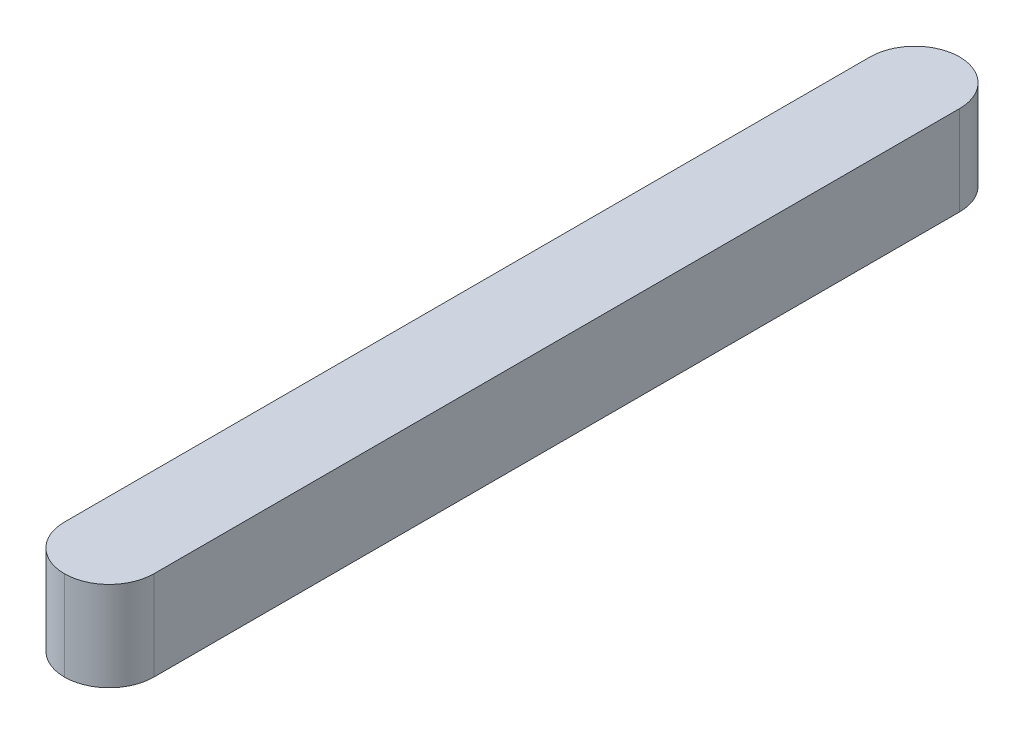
ISO-10303-21;
HEADER;
FILE_DESCRIPTION(('STEP AP214'),'2;1');
FILE_NAME('part.step','',(''),(''),'','','');
FILE_SCHEMA(('AUTOMOTIVE_DESIGN { 1 0 10303 214 1 1 1 1 }'));
ENDSEC;
DATA;
#1=APPLICATION_CONTEXT('core data for automotive mechanical design processes');
#2=APPLICATION_PROTOCOL_DEFINITION('international standard','automotive_design',2000,#1);
#3=PRODUCT_CONTEXT('',#1,'mechanical');
#4=PRODUCT('Part','Part','',(#3));
#5=PRODUCT_RELATED_PRODUCT_CATEGORY('part','',(#4));
#6=PRODUCT_DEFINITION_FORMATION('','',#4);
#7=PRODUCT_DEFINITION_CONTEXT('part definition',#1,'design');
#8=PRODUCT_DEFINITION('design','',#6,#7);
#9=PRODUCT_DEFINITION_SHAPE('','',#8);
#10=(LENGTH_UNIT() NAMED_UNIT(*) SI_UNIT(.MILLI.,.METRE.));
#11=(NAMED_UNIT(*) PLANE_ANGLE_UNIT() SI_UNIT($,.RADIAN.));
#12=(NAMED_UNIT(*) SI_UNIT($,.STERADIAN.) SOLID_ANGLE_UNIT());
#13=UNCERTAINTY_MEASURE_WITH_UNIT(LENGTH_MEASURE(1.E-05),#10,'distance_accuracy_value','');
#14=(GEOMETRIC_REPRESENTATION_CONTEXT(3) GLOBAL_UNCERTAINTY_ASSIGNED_CONTEXT((#13)) GLOBAL_UNIT_ASSIGNED_CONTEXT((#10,
#11,#12)) REPRESENTATION_CONTEXT('',''));
#15=CARTESIAN_POINT('',(0.,0.,0.));
#16=DIRECTION('',(0.,0.,1.));
#17=DIRECTION('',(1.,0.,0.));
#18=AXIS2_PLACEMENT_3D('',#15,#16,#17);
#19=CARTESIAN_POINT('',(0.,0.,60.));
#20=DIRECTION('',(1.,0.,0.));
#21=DIRECTION('',(0.,0.,-1.));
#22=AXIS2_PLACEMENT_3D('',#19,#20,#21);
#23=PLANE('',#22);
#24=DIRECTION('',(0.,0.,-1.));
#25=VECTOR('',#24,1.);
#26=CARTESIAN_POINT('',(0.,0.,60.));
#27=LINE('',#26,#25);
#28=CARTESIAN_POINT('',(0.,0.,57.));
#29=VERTEX_POINT('',#28);
#30=CARTESIAN_POINT('',(0.,0.,3.));
#31=VERTEX_POINT('',#30);
#32=EDGE_CURVE('E110',#29,#31,#27,.T.);
#33=ORIENTED_EDGE('',*,*,#32,.F.);
#34=DIRECTION('',(0.,-1.,0.));
#35=VECTOR('',#34,1.);
#36=CARTESIAN_POINT('',(0.,0.,57.));
#37=LINE('',#36,#35);
#38=CARTESIAN_POINT('',(0.,6.,57.));
#39=VERTEX_POINT('',#38);
#40=EDGE_CURVE('E11',#29,#39,#37,.F.);
#41=ORIENTED_EDGE('',*,*,#40,.T.);
#42=DIRECTION('',(0.,0.,-1.));
#43=VECTOR('',#42,1.);
#44=CARTESIAN_POINT('',(0.,6.,60.));
#45=LINE('',#44,#43);
#46=CARTESIAN_POINT('',(0.,6.,3.));
#47=VERTEX_POINT('',#46);
#48=EDGE_CURVE('E106',#39,#47,#45,.T.);
#49=ORIENTED_EDGE('',*,*,#48,.T.);
#50=DIRECTION('',(0.,-1.,0.));
#51=VECTOR('',#50,1.);
#52=CARTESIAN_POINT('',(0.,0.,3.));
#53=LINE('',#52,#51);
#54=EDGE_CURVE('E39',#47,#31,#53,.T.);
#55=ORIENTED_EDGE('',*,*,#54,.T.);
#56=EDGE_LOOP('',(#33,#41,#49,#55));
#57=FACE_BOUND('',#56,.T.);
#58=ADVANCED_FACE('F32',(#57),#23,.F.);
#59=CARTESIAN_POINT('',(0.,0.,60.));
#60=DIRECTION('',(0.,1.,0.));
#61=DIRECTION('',(0.,0.,1.));
#62=AXIS2_PLACEMENT_3D('',#59,#60,#61);
#63=PLANE('',#62);
#64=DIRECTION('',(0.,0.,-1.));
#65=VECTOR('',#64,1.);
#66=CARTESIAN_POINT('',(6.,0.,60.));
#67=LINE('',#66,#65);
#68=CARTESIAN_POINT('',(6.,0.,57.));
#69=VERTEX_POINT('',#68);
#70=CARTESIAN_POINT('',(6.,0.,3.));
#71=VERTEX_POINT('',#70);
#72=EDGE_CURVE('E105',#69,#71,#67,.T.);
#73=ORIENTED_EDGE('',*,*,#72,.F.);
#74=CARTESIAN_POINT('',(3.,0.,57.));
#75=DIRECTION('',(0.,1.,0.));
#76=DIRECTION('',(0.,0.,1.));
#77=AXIS2_PLACEMENT_3D('',#74,#75,#76);
#78=CIRCLE('',#77,3.);
#79=CARTESIAN_POINT('',(3.,0.,60.));
#80=VERTEX_POINT('',#79);
#81=EDGE_CURVE('E109',#69,#80,#78,.F.);
#82=ORIENTED_EDGE('',*,*,#81,.T.);
#83=CARTESIAN_POINT('',(3.,0.,57.));
#84=DIRECTION('',(0.,1.,0.));
#85=DIRECTION('',(0.,0.,1.));
#86=AXIS2_PLACEMENT_3D('',#83,#84,#85);
#87=CIRCLE('',#86,3.);
#88=EDGE_CURVE('E52',#80,#29,#87,.F.);
#89=ORIENTED_EDGE('',*,*,#88,.T.);
#90=ORIENTED_EDGE('',*,*,#32,.T.);
#91=CARTESIAN_POINT('',(3.,0.,3.));
#92=DIRECTION('',(0.,1.,0.));
#93=DIRECTION('',(0.,0.,1.));
#94=AXIS2_PLACEMENT_3D('',#91,#92,#93);
#95=CIRCLE('',#94,3.);
#96=CARTESIAN_POINT('',(3.,0.,0.));
#97=VERTEX_POINT('',#96);
#98=EDGE_CURVE('E94',#31,#97,#95,.F.);
#99=ORIENTED_EDGE('',*,*,#98,.T.);
#100=CARTESIAN_POINT('',(3.,0.,3.));
#101=DIRECTION('',(0.,1.,0.));
#102=DIRECTION('',(0.,0.,1.));
#103=AXIS2_PLACEMENT_3D('',#100,#101,#102);
#104=CIRCLE('',#103,3.);
#105=EDGE_CURVE('E122',#97,#71,#104,.F.);
#106=ORIENTED_EDGE('',*,*,#105,.T.);
#107=EDGE_LOOP('',(#73,#82,#89,#90,#99,#106));
#108=FACE_BOUND('',#107,.T.);
#109=ADVANCED_FACE('F125',(#108),#63,.F.);
#110=CARTESIAN_POINT('',(6.,0.,60.));
#111=DIRECTION('',(-1.,0.,0.));
#112=DIRECTION('',(0.,0.,1.));
#113=AXIS2_PLACEMENT_3D('',#110,#111,#112);
#114=PLANE('',#113);
#115=ORIENTED_EDGE('',*,*,#72,.T.);
#116=DIRECTION('',(0.,1.,0.));
#117=VECTOR('',#116,1.);
#118=CARTESIAN_POINT('',(6.,6.,3.));
#119=LINE('',#118,#117);
#120=CARTESIAN_POINT('',(6.,6.,3.));
#121=VERTEX_POINT('',#120);
#122=EDGE_CURVE('E104',#71,#121,#119,.T.);
#123=ORIENTED_EDGE('',*,*,#122,.T.);
#124=DIRECTION('',(0.,0.,-1.));
#125=VECTOR('',#124,1.);
#126=CARTESIAN_POINT('',(6.,6.,60.));
#127=LINE('',#126,#125);
#128=CARTESIAN_POINT('',(6.,6.,57.));
#129=VERTEX_POINT('',#128);
#130=EDGE_CURVE('E86',#129,#121,#127,.T.);
#131=ORIENTED_EDGE('',*,*,#130,.F.);
#132=DIRECTION('',(0.,1.,0.));
#133=VECTOR('',#132,1.);
#134=CARTESIAN_POINT('',(6.,0.,57.));
#135=LINE('',#134,#133);
#136=EDGE_CURVE('E101',#129,#69,#135,.F.);
#137=ORIENTED_EDGE('',*,*,#136,.T.);
#138=EDGE_LOOP('',(#115,#123,#131,#137));
#139=FACE_BOUND('',#138,.T.);
#140=ADVANCED_FACE('F100',(#139),#114,.F.);
#141=CARTESIAN_POINT('',(0.,6.,60.));
#142=DIRECTION('',(0.,-1.,0.));
#143=DIRECTION('',(0.,0.,-1.));
#144=AXIS2_PLACEMENT_3D('',#141,#142,#143);
#145=PLANE('',#144);
#146=CARTESIAN_POINT('',(3.,6.,57.));
#147=DIRECTION('',(0.,-1.,0.));
#148=DIRECTION('',(0.,0.,-1.));
#149=AXIS2_PLACEMENT_3D('',#146,#147,#148);
#150=CIRCLE('',#149,3.);
#151=CARTESIAN_POINT('',(3.,6.,60.));
#152=VERTEX_POINT('',#151);
#153=EDGE_CURVE('E89',#39,#152,#150,.F.);
#154=ORIENTED_EDGE('',*,*,#153,.T.);
#155=CARTESIAN_POINT('',(3.,6.,57.));
#156=DIRECTION('',(0.,-1.,0.));
#157=DIRECTION('',(0.,0.,-1.));
#158=AXIS2_PLACEMENT_3D('',#155,#156,#157);
#159=CIRCLE('',#158,3.);
#160=EDGE_CURVE('E83',#152,#129,#159,.F.);
#161=ORIENTED_EDGE('',*,*,#160,.T.);
#162=ORIENTED_EDGE('',*,*,#130,.T.);
#163=CARTESIAN_POINT('',(3.,6.,3.));
#164=DIRECTION('',(0.,-1.,0.));
#165=DIRECTION('',(0.,0.,-1.));
#166=AXIS2_PLACEMENT_3D('',#163,#164,#165);
#167=CIRCLE('',#166,3.);
#168=CARTESIAN_POINT('',(3.,6.,0.));
#169=VERTEX_POINT('',#168);
#170=EDGE_CURVE('E118',#121,#169,#167,.F.);
#171=ORIENTED_EDGE('',*,*,#170,.T.);
#172=CARTESIAN_POINT('',(3.,6.,3.));
#173=DIRECTION('',(0.,-1.,0.));
#174=DIRECTION('',(0.,0.,-1.));
#175=AXIS2_PLACEMENT_3D('',#172,#173,#174);
#176=CIRCLE('',#175,3.);
#177=EDGE_CURVE('E112',#169,#47,#176,.F.);
#178=ORIENTED_EDGE('',*,*,#177,.T.);
#179=ORIENTED_EDGE('',*,*,#48,.F.);
#180=EDGE_LOOP('',(#154,#161,#162,#171,#178,#179));
#181=FACE_BOUND('',#180,.T.);
#182=ADVANCED_FACE('F85',(#181),#145,.F.);
#183=CARTESIAN_POINT('',(3.,0.,3.));
#184=DIRECTION('',(0.,1.,0.));
#185=DIRECTION('',(0.,0.,1.));
#186=AXIS2_PLACEMENT_3D('',#183,#184,#185);
#187=CYLINDRICAL_SURFACE('',#186,3.);
#188=DIRECTION('',(0.,-1.,0.));
#189=VECTOR('',#188,1.);
#190=CARTESIAN_POINT('',(3.,6.,0.));
#191=LINE('',#190,#189);
#192=EDGE_CURVE('E130',#97,#169,#191,.F.);
#193=ORIENTED_EDGE('',*,*,#192,.F.);
#194=ORIENTED_EDGE('',*,*,#98,.F.);
#195=ORIENTED_EDGE('',*,*,#54,.F.);
#196=ORIENTED_EDGE('',*,*,#177,.F.);
#197=EDGE_LOOP('',(#193,#194,#195,#196));
#198=FACE_BOUND('',#197,.T.);
#199=ADVANCED_FACE('F141',(#198),#187,.T.);
#200=CARTESIAN_POINT('',(3.,0.,3.));
#201=DIRECTION('',(0.,-1.,0.));
#202=DIRECTION('',(0.,0.,-1.));
#203=AXIS2_PLACEMENT_3D('',#200,#201,#202);
#204=CYLINDRICAL_SURFACE('',#203,3.);
#205=ORIENTED_EDGE('',*,*,#105,.F.);
#206=ORIENTED_EDGE('',*,*,#192,.T.);
#207=ORIENTED_EDGE('',*,*,#170,.F.);
#208=ORIENTED_EDGE('',*,*,#122,.F.);
#209=EDGE_LOOP('',(#205,#206,#207,#208));
#210=FACE_BOUND('',#209,.T.);
#211=ADVANCED_FACE('F137',(#210),#204,.T.);
#212=CARTESIAN_POINT('',(3.,6.,57.));
#213=DIRECTION('',(0.,-1.,0.));
#214=DIRECTION('',(0.,0.,-1.));
#215=AXIS2_PLACEMENT_3D('',#212,#213,#214);
#216=CYLINDRICAL_SURFACE('',#215,3.);
#217=ORIENTED_EDGE('',*,*,#40,.F.);
#218=ORIENTED_EDGE('',*,*,#88,.F.);
#219=DIRECTION('',(0.,-1.,0.));
#220=VECTOR('',#219,1.);
#221=CARTESIAN_POINT('',(3.,6.,60.));
#222=LINE('',#221,#220);
#223=EDGE_CURVE('E129',#152,#80,#222,.T.);
#224=ORIENTED_EDGE('',*,*,#223,.F.);
#225=ORIENTED_EDGE('',*,*,#153,.F.);
#226=EDGE_LOOP('',(#217,#218,#224,#225));
#227=FACE_BOUND('',#226,.T.);
#228=ADVANCED_FACE('F128',(#227),#216,.T.);
#229=CARTESIAN_POINT('',(3.,6.,57.));
#230=DIRECTION('',(0.,1.,0.));
#231=DIRECTION('',(0.,0.,1.));
#232=AXIS2_PLACEMENT_3D('',#229,#230,#231);
#233=CYLINDRICAL_SURFACE('',#232,3.);
#234=ORIENTED_EDGE('',*,*,#81,.F.);
#235=ORIENTED_EDGE('',*,*,#136,.F.);
#236=ORIENTED_EDGE('',*,*,#160,.F.);
#237=ORIENTED_EDGE('',*,*,#223,.T.);
#238=EDGE_LOOP('',(#234,#235,#236,#237));
#239=FACE_BOUND('',#238,.T.);
#240=ADVANCED_FACE('F108',(#239),#233,.T.);
#241=CLOSED_SHELL('',(#58,#109,#140,#182,#199,#211,#228,#240));
#242=MANIFOLD_SOLID_BREP('B2',#241);
#243=ADVANCED_BREP_SHAPE_REPRESENTATION('',(#18,#242),#14);
#244=SHAPE_DEFINITION_REPRESENTATION(#9,#243);
ENDSEC;
END-ISO-10303-21;
